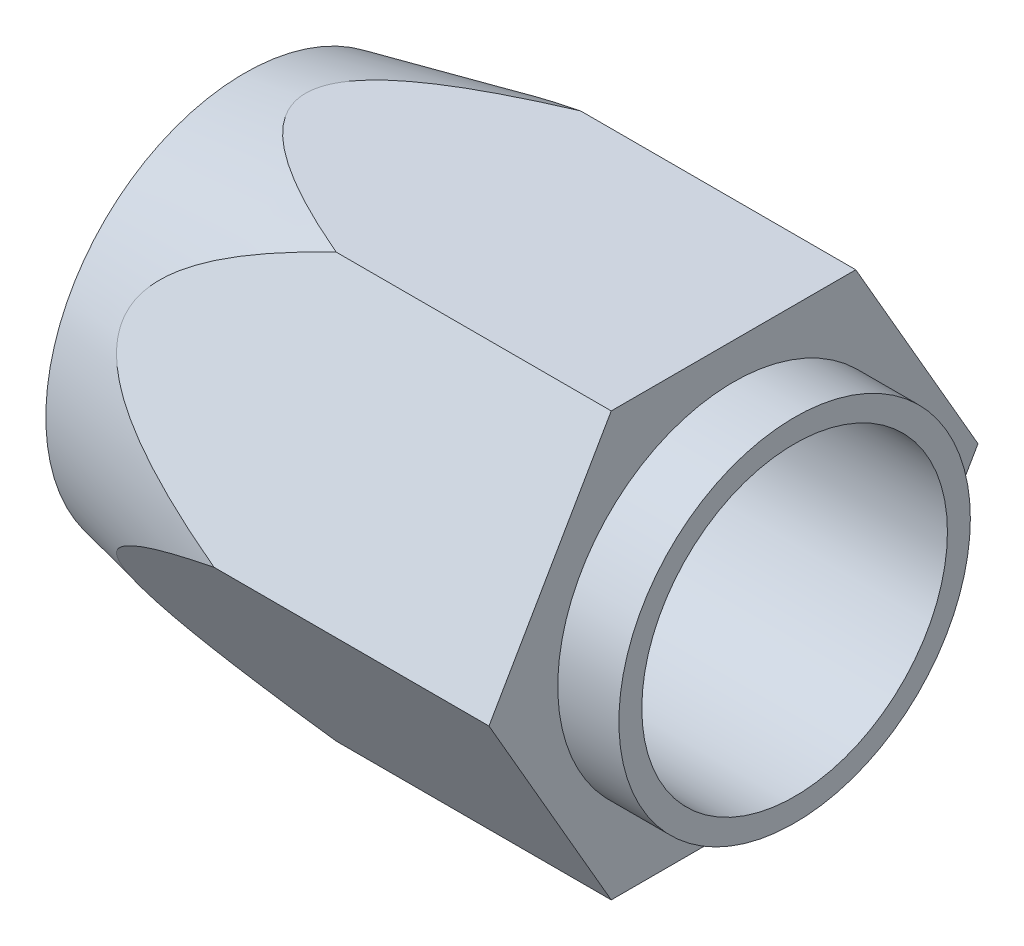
ISO-10303-21;
HEADER;
FILE_DESCRIPTION(('STEP AP214'),'2;1');
FILE_NAME('part.step','',(''),(''),'','','');
FILE_SCHEMA(('AUTOMOTIVE_DESIGN { 1 0 10303 214 1 1 1 1 }'));
ENDSEC;
DATA;
#1=APPLICATION_CONTEXT('core data for automotive mechanical design processes');
#2=APPLICATION_PROTOCOL_DEFINITION('international standard','automotive_design',2000,#1);
#3=PRODUCT_CONTEXT('',#1,'mechanical');
#4=PRODUCT('Part','Part','',(#3));
#5=PRODUCT_RELATED_PRODUCT_CATEGORY('part','',(#4));
#6=PRODUCT_DEFINITION_FORMATION('','',#4);
#7=PRODUCT_DEFINITION_CONTEXT('part definition',#1,'design');
#8=PRODUCT_DEFINITION('design','',#6,#7);
#9=PRODUCT_DEFINITION_SHAPE('','',#8);
#10=(LENGTH_UNIT() NAMED_UNIT(*) SI_UNIT(.MILLI.,.METRE.));
#11=(NAMED_UNIT(*) PLANE_ANGLE_UNIT() SI_UNIT($,.RADIAN.));
#12=(NAMED_UNIT(*) SI_UNIT($,.STERADIAN.) SOLID_ANGLE_UNIT());
#13=UNCERTAINTY_MEASURE_WITH_UNIT(LENGTH_MEASURE(1.E-05),#10,'distance_accuracy_value','');
#14=(GEOMETRIC_REPRESENTATION_CONTEXT(3) GLOBAL_UNCERTAINTY_ASSIGNED_CONTEXT((#13)) GLOBAL_UNIT_ASSIGNED_CONTEXT((#10,
#11,#12)) REPRESENTATION_CONTEXT('',''));
#15=CARTESIAN_POINT('',(0.,0.,0.));
#16=DIRECTION('',(0.,0.,1.));
#17=DIRECTION('',(1.,0.,0.));
#18=AXIS2_PLACEMENT_3D('',#15,#16,#17);
#19=CARTESIAN_POINT('',(16.,0.,0.));
#20=DIRECTION('',(1.,0.,0.));
#21=DIRECTION('',(0.,0.,-1.));
#22=AXIS2_PLACEMENT_3D('',#19,#20,#21);
#23=PLANE('',#22);
#24=CARTESIAN_POINT('',(16.,0.,0.));
#25=DIRECTION('',(1.,0.,0.));
#26=DIRECTION('',(0.,0.,-1.));
#27=AXIS2_PLACEMENT_3D('',#24,#25,#26);
#28=CIRCLE('',#27,5.75);
#29=CARTESIAN_POINT('',(16.,0.,-5.75));
#30=VERTEX_POINT('',#29);
#31=EDGE_CURVE('E19',#30,#30,#28,.T.);
#32=ORIENTED_EDGE('',*,*,#31,.F.);
#33=EDGE_LOOP('',(#32));
#34=FACE_BOUND('',#33,.T.);
#35=DIRECTION('',(0.,-0.866025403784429,0.500000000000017));
#36=VECTOR('',#35,1.);
#37=CARTESIAN_POINT('',(16.,6.928203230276,4.));
#38=LINE('',#37,#36);
#39=CARTESIAN_POINT('',(16.,1.32417225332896E-13,8.00000000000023));
#40=VERTEX_POINT('',#39);
#41=CARTESIAN_POINT('',(16.,6.928203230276,4.));
#42=VERTEX_POINT('',#41);
#43=EDGE_CURVE('E95',#40,#42,#38,.F.);
#44=ORIENTED_EDGE('',*,*,#43,.F.);
#45=DIRECTION('',(0.,-0.866025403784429,-0.500000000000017));
#46=VECTOR('',#45,1.);
#47=CARTESIAN_POINT('',(16.,0.,8.));
#48=LINE('',#47,#46);
#49=CARTESIAN_POINT('',(16.,-6.92820323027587,3.99999999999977));
#50=VERTEX_POINT('',#49);
#51=EDGE_CURVE('E100',#50,#40,#48,.F.);
#52=ORIENTED_EDGE('',*,*,#51,.F.);
#53=DIRECTION('',(0.,0.,-1.));
#54=VECTOR('',#53,1.);
#55=CARTESIAN_POINT('',(16.,-6.928203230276,4.));
#56=LINE('',#55,#54);
#57=CARTESIAN_POINT('',(16.,-6.928203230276,-4.));
#58=VERTEX_POINT('',#57);
#59=EDGE_CURVE('E105',#58,#50,#56,.F.);
#60=ORIENTED_EDGE('',*,*,#59,.F.);
#61=DIRECTION('',(0.,0.866025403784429,-0.500000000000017));
#62=VECTOR('',#61,1.);
#63=CARTESIAN_POINT('',(16.,-6.928203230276,-4.));
#64=LINE('',#63,#62);
#65=CARTESIAN_POINT('',(16.,0.,-8.00000000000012));
#66=VERTEX_POINT('',#65);
#67=EDGE_CURVE('E84',#66,#58,#64,.F.);
#68=ORIENTED_EDGE('',*,*,#67,.F.);
#69=DIRECTION('',(0.,0.866025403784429,0.500000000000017));
#70=VECTOR('',#69,1.);
#71=CARTESIAN_POINT('',(16.,0.,-8.));
#72=LINE('',#71,#70);
#73=CARTESIAN_POINT('',(16.,6.92820323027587,-3.99999999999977));
#74=VERTEX_POINT('',#73);
#75=EDGE_CURVE('E79',#74,#66,#72,.F.);
#76=ORIENTED_EDGE('',*,*,#75,.F.);
#77=DIRECTION('',(0.,0.,1.));
#78=VECTOR('',#77,1.);
#79=CARTESIAN_POINT('',(16.,6.928203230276,-4.));
#80=LINE('',#79,#78);
#81=EDGE_CURVE('E67',#42,#74,#80,.F.);
#82=ORIENTED_EDGE('',*,*,#81,.F.);
#83=EDGE_LOOP('',(#44,#52,#60,#68,#76,#82));
#84=FACE_BOUND('',#83,.T.);
#85=ADVANCED_FACE('F16',(#34,#84),#23,.T.);
#86=CARTESIAN_POINT('',(0.,-6.928203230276,-4.));
#87=DIRECTION('',(0.,-0.500000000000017,-0.866025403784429));
#88=DIRECTION('',(0.,0.866025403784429,-0.500000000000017));
#89=AXIS2_PLACEMENT_3D('',#86,#87,#88);
#90=PLANE('',#89);
#91=DIRECTION('',(1.,0.,0.));
#92=VECTOR('',#91,1.);
#93=CARTESIAN_POINT('',(0.,-6.928203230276,-4.));
#94=LINE('',#93,#92);
#95=CARTESIAN_POINT('',(6.99999996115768,-6.92820321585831,-4.00000000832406));
#96=VERTEX_POINT('',#95);
#97=EDGE_CURVE('E107',#96,#58,#94,.T.);
#98=ORIENTED_EDGE('',*,*,#97,.F.);
#99=CARTESIAN_POINT('',(7.00000000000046,-1.11640859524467E-12,-7.99999999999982));
#100=CARTESIAN_POINT('',(6.87265688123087,-0.0472672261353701,-7.97271025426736));
#101=CARTESIAN_POINT('',(6.74561469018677,-0.0951407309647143,-7.94507047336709));
#102=CARTESIAN_POINT('',(6.49221876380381,-0.192257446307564,-7.88900011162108));
#103=CARTESIAN_POINT('',(6.36586508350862,-0.241500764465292,-7.86056946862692));
#104=CARTESIAN_POINT('',(5.98753065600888,-0.391694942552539,-7.77385481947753));
#105=CARTESIAN_POINT('',(5.73674853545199,-0.494936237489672,-7.71424843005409));
#106=CARTESIAN_POINT('',(5.24148256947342,-0.708414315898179,-7.59099680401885));
#107=CARTESIAN_POINT('',(4.99696581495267,-0.818593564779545,-7.52738478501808));
#108=CARTESIAN_POINT('',(4.51446996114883,-1.04899700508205,-7.3943612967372));
#109=CARTESIAN_POINT('',(4.2764855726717,-1.16921273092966,-7.32495471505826));
#110=CARTESIAN_POINT('',(3.88880209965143,-1.38097779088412,-7.20269210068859));
#111=CARTESIAN_POINT('',(3.73626687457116,-1.46861610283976,-7.15209409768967));
#112=CARTESIAN_POINT('',(3.43662864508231,-1.65244292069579,-7.04596163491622));
#113=CARTESIAN_POINT('',(3.289566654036,-1.74868255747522,-6.9903976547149));
#114=CARTESIAN_POINT('',(3.05556825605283,-1.91587951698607,-6.89386644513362));
#115=CARTESIAN_POINT('',(2.96572772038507,-1.98377409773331,-6.85466749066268));
#116=CARTESIAN_POINT('',(2.79167839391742,-2.12497886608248,-6.77314287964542));
#117=CARTESIAN_POINT('',(2.70747484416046,-2.19829396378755,-6.73081438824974));
#118=CARTESIAN_POINT('',(2.54777816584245,-2.35071410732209,-6.64281457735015));
#119=CARTESIAN_POINT('',(2.47221921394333,-2.42976668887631,-6.59717354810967));
#120=CARTESIAN_POINT('',(2.33268075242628,-2.59509526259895,-6.50172105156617));
#121=CARTESIAN_POINT('',(2.26867217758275,-2.68135230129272,-6.45192052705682));
#122=CARTESIAN_POINT('',(2.1691285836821,-2.84247247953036,-6.35889774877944));
#123=CARTESIAN_POINT('',(2.13043256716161,-2.91584626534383,-6.31653537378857));
#124=CARTESIAN_POINT('',(2.06651997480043,-3.06690215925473,-6.22932321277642));
#125=CARTESIAN_POINT('',(2.04128764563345,-3.1445791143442,-6.18447640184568));
#126=CARTESIAN_POINT('',(2.00703851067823,-3.3033790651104,-6.09279320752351));
#127=CARTESIAN_POINT('',(1.99816763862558,-3.3845265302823,-6.04594269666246));
#128=CARTESIAN_POINT('',(1.99839807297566,-3.54682739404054,-5.95223824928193));
#129=CARTESIAN_POINT('',(2.00750391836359,-3.62798078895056,-5.90538431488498));
#130=CARTESIAN_POINT('',(2.04065302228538,-3.7797371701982,-5.8177677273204));
#131=CARTESIAN_POINT('',(2.063167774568,-3.85060185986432,-5.77685397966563));
#132=CARTESIAN_POINT('',(2.11954328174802,-3.98879057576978,-5.69707068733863));
#133=CARTESIAN_POINT('',(2.153406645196,-4.05611378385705,-5.65820161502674));
#134=CARTESIAN_POINT('',(2.25961579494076,-4.23713595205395,-5.55368841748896));
#135=CARTESIAN_POINT('',(2.34150712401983,-4.34659339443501,-5.49049313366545));
#136=CARTESIAN_POINT('',(2.52282053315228,-4.5541261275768,-5.37067405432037));
#137=CARTESIAN_POINT('',(2.62231633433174,-4.65215055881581,-5.31407962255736));
#138=CARTESIAN_POINT('',(2.80179381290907,-4.81159731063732,-5.2220229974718));
#139=CARTESIAN_POINT('',(2.87904171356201,-4.8753769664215,-5.18519979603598));
#140=CARTESIAN_POINT('',(3.03774498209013,-4.9989017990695,-5.11388270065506));
#141=CARTESIAN_POINT('',(3.11920169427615,-5.05864567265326,-5.07938955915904));
#142=CARTESIAN_POINT('',(3.36860734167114,-5.23297539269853,-4.97874024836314));
#143=CARTESIAN_POINT('',(3.54132243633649,-5.34243160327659,-4.91554567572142));
#144=CARTESIAN_POINT('',(3.89562308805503,-5.55194773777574,-4.79458147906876));
#145=CARTESIAN_POINT('',(4.0772582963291,-5.65194311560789,-4.73684912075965));
#146=CARTESIAN_POINT('',(4.44591881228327,-5.84424584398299,-4.62582308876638));
#147=CARTESIAN_POINT('',(4.63294579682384,-5.93655076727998,-4.57253081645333));
#148=CARTESIAN_POINT('',(5.00033307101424,-6.11017633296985,-4.47228804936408));
#149=CARTESIAN_POINT('',(5.18049033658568,-6.19182211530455,-4.42514983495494));
#150=CARTESIAN_POINT('',(5.54341642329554,-6.35075058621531,-4.33339243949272));
#151=CARTESIAN_POINT('',(5.72618606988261,-6.42803185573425,-4.28877407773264));
#152=CARTESIAN_POINT('',(6.09000990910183,-6.57744443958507,-4.20251068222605));
#153=CARTESIAN_POINT('',(6.27102470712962,-6.64964805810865,-4.16082390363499));
#154=CARTESIAN_POINT('',(6.63449583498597,-6.79104334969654,-4.07918929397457));
#155=CARTESIAN_POINT('',(6.81695129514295,-6.8602366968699,-4.0392404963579));
#156=CARTESIAN_POINT('',(6.99999992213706,-6.92820320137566,-4.00000001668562));
#157=B_SPLINE_CURVE_WITH_KNOTS('',3,(#99,#100,#101,#102,#103,#104,#105,#106,#107,#108,#109,#110,
#111,#112,#113,#114,#115,#116,#117,#118,#119,#120,#121,#122,#123,#124,#125,#126,#127,#128,#129,
#130,#131,#132,#133,#134,#135,#136,#137,#138,#139,#140,#141,#142,#143,#144,#145,#146,#147,#148,
#149,#150,#151,#152,#153,#154,#155,#156),.UNSPECIFIED.,.F.,.F.,(4,2,2,2,2,2,2,2,2,2,2,2,2,2,2,2,
2,2,2,2,2,2,2,2,2,2,2,2,4),(0.,0.415635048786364,0.831302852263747,1.6641767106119,
2.49087611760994,3.31688513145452,3.86581444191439,4.41825684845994,4.77575088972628,
5.13357282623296,5.48845770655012,5.84243671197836,6.12097828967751,6.39919323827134,
6.67987790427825,6.96063345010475,7.21425825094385,7.46794138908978,7.91711501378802,
8.36821616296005,8.68819996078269,9.00828660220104,9.64958384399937,10.2949810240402,
10.9405811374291,11.5504912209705,12.1605984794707,12.7584388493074,13.3559423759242),.UNSPECIFIED.);
#158=CARTESIAN_POINT('',(7.00000000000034,-3.57415779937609E-13,-7.99999999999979));
#159=VERTEX_POINT('',#158);
#160=EDGE_CURVE('E167',#159,#96,#157,.T.);
#161=ORIENTED_EDGE('',*,*,#160,.F.);
#162=DIRECTION('',(1.,0.,0.));
#163=VECTOR('',#162,1.);
#164=CARTESIAN_POINT('',(0.,0.,-8.));
#165=LINE('',#164,#163);
#166=EDGE_CURVE('E33',#66,#159,#165,.F.);
#167=ORIENTED_EDGE('',*,*,#166,.F.);
#168=ORIENTED_EDGE('',*,*,#67,.T.);
#169=EDGE_LOOP('',(#98,#161,#167,#168));
#170=FACE_BOUND('',#169,.T.);
#171=ADVANCED_FACE('F175',(#170),#90,.T.);
#172=CARTESIAN_POINT('',(0.,-6.928203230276,4.));
#173=DIRECTION('',(0.,-1.,0.));
#174=DIRECTION('',(0.,0.,-1.));
#175=AXIS2_PLACEMENT_3D('',#172,#173,#174);
#176=PLANE('',#175);
#177=DIRECTION('',(1.,0.,0.));
#178=VECTOR('',#177,1.);
#179=CARTESIAN_POINT('',(0.,-6.9282032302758,3.99999999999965));
#180=LINE('',#179,#178);
#181=CARTESIAN_POINT('',(6.99999996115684,-6.9282032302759,3.9999999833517));
#182=VERTEX_POINT('',#181);
#183=EDGE_CURVE('E102',#182,#50,#180,.T.);
#184=ORIENTED_EDGE('',*,*,#183,.F.);
#185=CARTESIAN_POINT('',(6.99999992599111,-6.928203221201,-3.99999996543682));
#186=CARTESIAN_POINT('',(6.87265680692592,-6.92820322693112,-3.94542047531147));
#187=CARTESIAN_POINT('',(6.74561461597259,-6.9282032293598,-3.89014091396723));
#188=CARTESIAN_POINT('',(6.49221869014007,-6.92820323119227,-3.77800019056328));
#189=CARTESIAN_POINT('',(6.36586501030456,-6.92820323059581,-3.7211389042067));
#190=CARTESIAN_POINT('',(5.98753058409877,-6.92820322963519,-3.54770960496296));
#191=CARTESIAN_POINT('',(5.73674846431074,-6.92820323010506,-3.42849682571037));
#192=CARTESIAN_POINT('',(5.24148250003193,-6.92820323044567,-3.18199357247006));
#193=CARTESIAN_POINT('',(4.99696574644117,-6.92820323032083,-3.0547695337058));
#194=CARTESIAN_POINT('',(4.51446989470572,-6.9282032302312,-2.78872255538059));
#195=CARTESIAN_POINT('',(4.27648550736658,-6.92820323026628,-2.64990939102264));
#196=CARTESIAN_POINT('',(3.88880204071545,-6.92820323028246,-2.40538416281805));
#197=CARTESIAN_POINT('',(3.73626682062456,-6.92820323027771,-2.30418815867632));
#198=CARTESIAN_POINT('',(3.43662860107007,-6.92820323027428,-2.09192323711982));
#199=CARTESIAN_POINT('',(3.28956661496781,-6.92820323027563,-1.98079527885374));
#200=CARTESIAN_POINT('',(3.0555682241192,-6.92820323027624,-1.78773286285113));
#201=CARTESIAN_POINT('',(2.96572769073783,-6.92820323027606,-1.70933495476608));
#202=CARTESIAN_POINT('',(2.79167836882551,-6.92820323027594,-1.54628573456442));
#203=CARTESIAN_POINT('',(2.70747482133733,-6.92820323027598,-1.46162875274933));
#204=CARTESIAN_POINT('',(2.54777814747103,-6.92820323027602,-1.28562913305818));
#205=CARTESIAN_POINT('',(2.47221919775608,-6.928203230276,-1.19434707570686));
#206=CARTESIAN_POINT('',(2.33268074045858,-6.928203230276,-1.00344208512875));
#207=CARTESIAN_POINT('',(2.26867216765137,-6.928203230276,-0.90384103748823));
#208=CARTESIAN_POINT('',(2.16912857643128,-6.928203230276,-0.717795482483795));
#209=CARTESIAN_POINT('',(2.13043256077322,-6.928203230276,-0.633070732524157));
#210=CARTESIAN_POINT('',(2.06651997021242,-6.928203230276,-0.458646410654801));
#211=CARTESIAN_POINT('',(2.04128764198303,-6.928203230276,-0.368952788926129));
#212=CARTESIAN_POINT('',(2.00703850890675,-6.928203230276,-0.185586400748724));
#213=CARTESIAN_POINT('',(1.99816763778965,-6.928203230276,-0.091885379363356));
#214=CARTESIAN_POINT('',(1.99839807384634,-6.928203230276,0.0955235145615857));
#215=CARTESIAN_POINT('',(2.00750392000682,-6.928203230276,0.189231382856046));
#216=CARTESIAN_POINT('',(2.04065302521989,-6.928203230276,0.364464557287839));
#217=CARTESIAN_POINT('',(2.06316777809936,-6.928203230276,0.446292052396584));
#218=CARTESIAN_POINT('',(2.11954328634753,-6.928203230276,0.605858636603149));
#219=CARTESIAN_POINT('',(2.15340665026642,-6.928203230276,0.683596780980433));
#220=CARTESIAN_POINT('',(2.25961580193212,-6.928203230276,0.892623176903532));
#221=CARTESIAN_POINT('',(2.34150713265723,-6.928203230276,1.01901374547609));
#222=CARTESIAN_POINT('',(2.52282054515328,-6.928203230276,1.25865190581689));
#223=CARTESIAN_POINT('',(2.62231634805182,-6.928203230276,1.37184077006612));
#224=CARTESIAN_POINT('',(2.80179383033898,-6.928203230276,1.55595402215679));
#225=CARTESIAN_POINT('',(2.87904173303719,-6.928203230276,1.62960042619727));
#226=CARTESIAN_POINT('',(3.03774500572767,-6.928203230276,1.77223461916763));
#227=CARTESIAN_POINT('',(3.11920172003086,-6.928203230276,1.84122090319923));
#228=CARTESIAN_POINT('',(3.36860737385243,-6.928203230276,2.0425195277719));
#229=CARTESIAN_POINT('',(3.5413224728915,-6.928203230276,2.16890867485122));
#230=CARTESIAN_POINT('',(3.89562313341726,-6.928203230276,2.41083707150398));
#231=CARTESIAN_POINT('',(4.07725834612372,-6.928203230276,2.5263017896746));
#232=CARTESIAN_POINT('',(4.44591887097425,-6.928203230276,2.7483538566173));
#233=CARTESIAN_POINT('',(4.63294585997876,-6.928203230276,2.8549384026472));
#234=CARTESIAN_POINT('',(5.00033313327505,-6.928203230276,3.05542393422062));
#235=CARTESIAN_POINT('',(5.18049039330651,-6.928203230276,3.14970035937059));
#236=CARTESIAN_POINT('',(5.54341646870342,-6.928203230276,3.33321514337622));
#237=CARTESIAN_POINT('',(5.72618610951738,-6.928203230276,3.42245186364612));
#238=CARTESIAN_POINT('',(6.09000993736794,-6.928203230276,3.59497864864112));
#239=CARTESIAN_POINT('',(6.27102472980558,-6.928203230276,3.67835220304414));
#240=CARTESIAN_POINT('',(6.63449584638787,-6.928203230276,3.84162141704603));
#241=CARTESIAN_POINT('',(6.81695130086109,-6.928203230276,3.92151900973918));
#242=CARTESIAN_POINT('',(6.999999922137,-6.928203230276,3.99999996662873));
#243=B_SPLINE_CURVE_WITH_KNOTS('',3,(#185,#186,#187,#188,#189,#190,#191,#192,#193,#194,#195,
#196,#197,#198,#199,#200,#201,#202,#203,#204,#205,#206,#207,#208,#209,#210,#211,#212,#213,#214,
#215,#216,#217,#218,#219,#220,#221,#222,#223,#224,#225,#226,#227,#228,#229,#230,#231,#232,#233,
#234,#235,#236,#237,#238,#239,#240,#241,#242),.UNSPECIFIED.,.F.,.F.,(4,2,2,2,2,2,2,2,2,2,2,2,2,
2,2,2,2,2,2,2,2,2,2,2,2,2,2,2,4),(0.,0.415635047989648,0.831302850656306,1.66417670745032,
2.49087611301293,3.31688512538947,3.8658144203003,4.41825681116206,4.77575084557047,
5.1335727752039,5.48845764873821,5.84243664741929,6.12097822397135,6.39919317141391,
6.67987783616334,6.96063338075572,7.21425818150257,7.46794131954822,7.91711494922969,
8.3682161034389,8.68819990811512,9.008286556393,9.64958381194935,10.294981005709,
10.9405811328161,11.5504911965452,12.1605984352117,12.7584387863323,13.3559422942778),.UNSPECIFIED.);
#244=EDGE_CURVE('E162',#96,#182,#243,.T.);
#245=ORIENTED_EDGE('',*,*,#244,.F.);
#246=ORIENTED_EDGE('',*,*,#97,.T.);
#247=ORIENTED_EDGE('',*,*,#59,.T.);
#248=EDGE_LOOP('',(#184,#245,#246,#247));
#249=FACE_BOUND('',#248,.T.);
#250=ADVANCED_FACE('F172',(#249),#176,.T.);
#251=CARTESIAN_POINT('',(0.,0.,8.));
#252=DIRECTION('',(0.,-0.500000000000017,0.866025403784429));
#253=DIRECTION('',(0.,-0.866025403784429,-0.500000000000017));
#254=AXIS2_PLACEMENT_3D('',#251,#252,#253);
#255=PLANE('',#254);
#256=DIRECTION('',(1.,0.,0.));
#257=VECTOR('',#256,1.);
#258=CARTESIAN_POINT('',(0.,1.98625837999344E-13,8.00000000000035));
#259=LINE('',#258,#257);
#260=CARTESIAN_POINT('',(7.00000000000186,-1.96959231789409E-13,8.00000000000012));
#261=VERTEX_POINT('',#260);
#262=EDGE_CURVE('E97',#261,#40,#259,.T.);
#263=ORIENTED_EDGE('',*,*,#262,.F.);
#264=CARTESIAN_POINT('',(6.99999992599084,-6.92820319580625,4.00000000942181));
#265=CARTESIAN_POINT('',(6.87265680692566,-6.88093597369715,4.02728975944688));
#266=CARTESIAN_POINT('',(6.74561461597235,-6.83306247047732,4.05492954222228));
#267=CARTESIAN_POINT('',(6.49221869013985,-6.73594575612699,4.1109999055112));
#268=CARTESIAN_POINT('',(6.36586501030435,-6.68670243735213,4.13943054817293));
#269=CARTESIAN_POINT('',(5.9875305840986,-6.53650825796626,4.22614519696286));
#270=CARTESIAN_POINT('',(5.73674846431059,-6.43326696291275,4.28575158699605));
#271=CARTESIAN_POINT('',(5.24148250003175,-6.2197888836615,4.40900321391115));
#272=CARTESIAN_POINT('',(4.99696574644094,-6.1096096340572,4.47261523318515));
#273=CARTESIAN_POINT('',(4.5144698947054,-5.87920619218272,4.60563872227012));
#274=CARTESIAN_POINT('',(4.2764855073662,-5.7589904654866,4.67504530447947));
#275=CARTESIAN_POINT('',(3.88880204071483,-5.5472254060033,4.79730791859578));
#276=CARTESIAN_POINT('',(3.73626682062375,-5.45958709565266,4.84790592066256));
#277=CARTESIAN_POINT('',(3.43662860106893,-5.27576028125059,4.95403838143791));
#278=CARTESIAN_POINT('',(3.2895666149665,-5.17952064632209,5.00960236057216));
#279=CARTESIAN_POINT('',(3.05556822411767,-5.01232368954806,5.10613356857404));
#280=CARTESIAN_POINT('',(2.96572769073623,-4.94442910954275,5.14533252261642));
#281=CARTESIAN_POINT('',(2.79167836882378,-4.80322434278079,5.22685713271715));
#282=CARTESIAN_POINT('',(2.70747482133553,-4.72990924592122,5.26918562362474));
#283=CARTESIAN_POINT('',(2.54777814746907,-4.57748910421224,5.35718543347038));
#284=CARTESIAN_POINT('',(2.47221919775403,-4.49843652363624,5.40282646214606));
#285=CARTESIAN_POINT('',(2.33268074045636,-4.33310795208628,5.49827895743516));
#286=CARTESIAN_POINT('',(2.26867216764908,-4.246850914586,5.54807948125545));
#287=CARTESIAN_POINT('',(2.16912857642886,-4.08573073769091,5.64110225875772));
#288=CARTESIAN_POINT('',(2.13043256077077,-4.01235695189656,5.68346463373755));
#289=CARTESIAN_POINT('',(2.06651997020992,-3.86130105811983,5.77067679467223));
#290=CARTESIAN_POINT('',(2.04128764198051,-3.7836241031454,5.81552360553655));
#291=CARTESIAN_POINT('',(2.00703850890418,-3.62482415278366,5.9072067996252));
#292=CARTESIAN_POINT('',(1.99816763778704,-3.54367668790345,5.95405731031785));
#293=CARTESIAN_POINT('',(1.99839807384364,-3.3813758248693,6.04776175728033));
#294=CARTESIAN_POINT('',(2.00750392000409,-3.30022243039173,6.09461569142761));
#295=CARTESIAN_POINT('',(2.04065302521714,-3.14846604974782,6.18223227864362));
#296=CARTESIAN_POINT('',(2.06316777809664,-3.07760136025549,6.22314602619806));
#297=CARTESIAN_POINT('',(2.1195432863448,-2.9394126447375,6.30292931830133));
#298=CARTESIAN_POINT('',(2.15340665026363,-2.87208943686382,6.34179839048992));
#299=CARTESIAN_POINT('',(2.25961580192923,-2.691067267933,6.44631158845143));
#300=CARTESIAN_POINT('',(2.34150713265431,-2.5816098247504,6.50950687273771));
#301=CARTESIAN_POINT('',(2.52282054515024,-2.37407709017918,6.62932595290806));
#302=CARTESIAN_POINT('',(2.62231634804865,-2.27605265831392,6.68592038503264));
#303=CARTESIAN_POINT('',(2.80179383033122,-2.11660590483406,6.77797701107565));
#304=CARTESIAN_POINT('',(2.87904173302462,-2.0528262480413,6.81480021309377));
#305=CARTESIAN_POINT('',(3.03774500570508,-1.92930141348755,6.88611730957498));
#306=CARTESIAN_POINT('',(3.11920172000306,-1.86955753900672,6.92061045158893));
#307=CARTESIAN_POINT('',(3.36860737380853,-1.69522781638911,7.02125976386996));
#308=CARTESIAN_POINT('',(3.5413224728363,-1.58577160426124,7.08445433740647));
#309=CARTESIAN_POINT('',(3.89562313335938,-1.37625546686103,7.20541853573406));
#310=CARTESIAN_POINT('',(4.07725834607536,-1.27626008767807,7.26315089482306));
#311=CARTESIAN_POINT('',(4.44591887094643,-1.08395735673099,7.37417692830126));
#312=CARTESIAN_POINT('',(4.63294585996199,-0.991652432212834,7.42746920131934));
#313=CARTESIAN_POINT('',(5.00033313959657,-0.81802686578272,7.52771196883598));
#314=CARTESIAN_POINT('',(5.18049040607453,-0.736381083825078,7.57485018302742));
#315=CARTESIAN_POINT('',(5.54341649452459,-0.577452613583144,7.6666075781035));
#316=CARTESIAN_POINT('',(5.72618614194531,-0.500171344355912,7.71122593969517));
#317=CARTESIAN_POINT('',(6.09000998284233,-0.35075876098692,7.79748933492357));
#318=CARTESIAN_POINT('',(6.2710247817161,-0.278555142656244,7.83917611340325));
#319=CARTESIAN_POINT('',(6.63449591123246,-0.137159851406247,7.92081072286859));
#320=CARTESIAN_POINT('',(6.81695137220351,-0.0679665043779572,7.9607595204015));
#321=CARTESIAN_POINT('',(7.00000000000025,-3.93285059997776E-13,7.99999999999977));
#322=B_SPLINE_CURVE_WITH_KNOTS('',3,(#264,#265,#266,#267,#268,#269,#270,#271,#272,#273,#274,
#275,#276,#277,#278,#279,#280,#281,#282,#283,#284,#285,#286,#287,#288,#289,#290,#291,#292,#293,
#294,#295,#296,#297,#298,#299,#300,#301,#302,#303,#304,#305,#306,#307,#308,#309,#310,#311,#312,
#313,#314,#315,#316,#317,#318,#319,#320,#321),.UNSPECIFIED.,.F.,.F.,(4,2,2,2,2,2,2,2,2,2,2,2,2,
2,2,2,2,2,2,2,2,2,2,2,2,2,2,2,4),(0.,0.415635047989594,0.831302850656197,1.66417670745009,
2.49087611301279,3.31688512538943,3.86581442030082,4.41825681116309,4.77575084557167,
5.13357277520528,5.48845764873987,5.84243664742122,6.12097822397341,6.39919317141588,
6.67987783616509,6.96063338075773,7.21425818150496,7.46794131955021,7.91711494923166,
8.36821610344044,8.68819990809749,9.00828655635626,9.64958381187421,10.2949810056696,
10.9405811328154,11.550491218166,12.1605984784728,12.7584388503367,13.3559423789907),.UNSPECIFIED.);
#323=EDGE_CURVE('E156',#182,#261,#322,.T.);
#324=ORIENTED_EDGE('',*,*,#323,.F.);
#325=ORIENTED_EDGE('',*,*,#183,.T.);
#326=ORIENTED_EDGE('',*,*,#51,.T.);
#327=EDGE_LOOP('',(#263,#324,#325,#326));
#328=FACE_BOUND('',#327,.T.);
#329=ADVANCED_FACE('F146',(#328),#255,.T.);
#330=CARTESIAN_POINT('',(0.,6.928203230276,4.));
#331=DIRECTION('',(0.,0.500000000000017,0.866025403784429));
#332=DIRECTION('',(0.,-0.866025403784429,0.500000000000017));
#333=AXIS2_PLACEMENT_3D('',#330,#331,#332);
#334=PLANE('',#333);
#335=DIRECTION('',(1.,0.,0.));
#336=VECTOR('',#335,1.);
#337=CARTESIAN_POINT('',(0.,6.928203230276,4.));
#338=LINE('',#337,#336);
#339=CARTESIAN_POINT('',(6.99999996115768,6.92820321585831,4.00000000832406));
#340=VERTEX_POINT('',#339);
#341=EDGE_CURVE('E73',#340,#42,#338,.T.);
#342=ORIENTED_EDGE('',*,*,#341,.F.);
#343=CARTESIAN_POINT('',(7.00000000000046,1.11609577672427E-12,7.99999999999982));
#344=CARTESIAN_POINT('',(6.87265688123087,0.0472672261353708,7.97271025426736));
#345=CARTESIAN_POINT('',(6.74561469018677,0.095140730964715,7.94507047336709));
#346=CARTESIAN_POINT('',(6.49221876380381,0.192257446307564,7.88900011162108));
#347=CARTESIAN_POINT('',(6.36586508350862,0.241500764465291,7.86056946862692));
#348=CARTESIAN_POINT('',(5.98753065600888,0.391694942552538,7.77385481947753));
#349=CARTESIAN_POINT('',(5.736748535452,0.494936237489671,7.71424843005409));
#350=CARTESIAN_POINT('',(5.24148256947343,0.708414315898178,7.59099680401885));
#351=CARTESIAN_POINT('',(4.99696581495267,0.818593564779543,7.52738478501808));
#352=CARTESIAN_POINT('',(4.51446996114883,1.04899700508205,7.3943612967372));
#353=CARTESIAN_POINT('',(4.2764855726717,1.16921273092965,7.32495471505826));
#354=CARTESIAN_POINT('',(3.88880209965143,1.38097779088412,7.20269210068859));
#355=CARTESIAN_POINT('',(3.73626687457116,1.46861610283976,7.15209409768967));
#356=CARTESIAN_POINT('',(3.43662864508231,1.65244292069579,7.04596163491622));
#357=CARTESIAN_POINT('',(3.289566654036,1.74868255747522,6.9903976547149));
#358=CARTESIAN_POINT('',(3.05556825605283,1.91587951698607,6.89386644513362));
#359=CARTESIAN_POINT('',(2.96572772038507,1.98377409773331,6.85466749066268));
#360=CARTESIAN_POINT('',(2.79167839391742,2.12497886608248,6.77314287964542));
#361=CARTESIAN_POINT('',(2.70747484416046,2.19829396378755,6.73081438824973));
#362=CARTESIAN_POINT('',(2.54777816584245,2.35071410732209,6.64281457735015));
#363=CARTESIAN_POINT('',(2.47221921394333,2.42976668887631,6.59717354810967));
#364=CARTESIAN_POINT('',(2.33268075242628,2.59509526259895,6.50172105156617));
#365=CARTESIAN_POINT('',(2.26867217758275,2.68135230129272,6.45192052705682));
#366=CARTESIAN_POINT('',(2.1691285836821,2.84247247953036,6.35889774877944));
#367=CARTESIAN_POINT('',(2.13043256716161,2.91584626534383,6.31653537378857));
#368=CARTESIAN_POINT('',(2.06651997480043,3.06690215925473,6.22932321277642));
#369=CARTESIAN_POINT('',(2.04128764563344,3.14457911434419,6.18447640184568));
#370=CARTESIAN_POINT('',(2.00703851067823,3.3033790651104,6.09279320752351));
#371=CARTESIAN_POINT('',(1.99816763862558,3.38452653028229,6.04594269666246));
#372=CARTESIAN_POINT('',(1.99839807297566,3.54682739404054,5.95223824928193));
#373=CARTESIAN_POINT('',(2.00750391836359,3.62798078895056,5.90538431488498));
#374=CARTESIAN_POINT('',(2.04065302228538,3.7797371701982,5.8177677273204));
#375=CARTESIAN_POINT('',(2.063167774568,3.85060185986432,5.77685397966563));
#376=CARTESIAN_POINT('',(2.11954328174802,3.98879057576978,5.69707068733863));
#377=CARTESIAN_POINT('',(2.153406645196,4.05611378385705,5.65820161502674));
#378=CARTESIAN_POINT('',(2.25961579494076,4.23713595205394,5.55368841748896));
#379=CARTESIAN_POINT('',(2.34150712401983,4.34659339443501,5.49049313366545));
#380=CARTESIAN_POINT('',(2.52282053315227,4.5541261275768,5.37067405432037));
#381=CARTESIAN_POINT('',(2.62231633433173,4.65215055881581,5.31407962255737));
#382=CARTESIAN_POINT('',(2.80179381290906,4.81159731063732,5.2220229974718));
#383=CARTESIAN_POINT('',(2.87904171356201,4.87537696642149,5.18519979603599));
#384=CARTESIAN_POINT('',(3.03774498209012,4.99890179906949,5.11388270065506));
#385=CARTESIAN_POINT('',(3.11920169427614,5.05864567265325,5.07938955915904));
#386=CARTESIAN_POINT('',(3.36860734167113,5.23297539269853,4.97874024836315));
#387=CARTESIAN_POINT('',(3.54132243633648,5.34243160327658,4.91554567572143));
#388=CARTESIAN_POINT('',(3.89562308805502,5.55194773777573,4.79458147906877));
#389=CARTESIAN_POINT('',(4.07725829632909,5.65194311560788,4.73684912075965));
#390=CARTESIAN_POINT('',(4.44591881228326,5.84424584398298,4.62582308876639));
#391=CARTESIAN_POINT('',(4.63294579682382,5.93655076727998,4.57253081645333));
#392=CARTESIAN_POINT('',(5.00033307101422,6.11017633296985,4.47228804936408));
#393=CARTESIAN_POINT('',(5.18049033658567,6.19182211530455,4.42514983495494));
#394=CARTESIAN_POINT('',(5.54341642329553,6.3507505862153,4.33339243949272));
#395=CARTESIAN_POINT('',(5.7261860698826,6.42803185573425,4.28877407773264));
#396=CARTESIAN_POINT('',(6.09000990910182,6.57744443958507,4.20251068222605));
#397=CARTESIAN_POINT('',(6.27102470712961,6.64964805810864,4.16082390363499));
#398=CARTESIAN_POINT('',(6.63449583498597,6.79104334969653,4.07918929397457));
#399=CARTESIAN_POINT('',(6.81695129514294,6.8602366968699,4.0392404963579));
#400=CARTESIAN_POINT('',(6.99999992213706,6.92820320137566,4.00000001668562));
#401=B_SPLINE_CURVE_WITH_KNOTS('',3,(#343,#344,#345,#346,#347,#348,#349,#350,#351,#352,#353,
#354,#355,#356,#357,#358,#359,#360,#361,#362,#363,#364,#365,#366,#367,#368,#369,#370,#371,#372,
#373,#374,#375,#376,#377,#378,#379,#380,#381,#382,#383,#384,#385,#386,#387,#388,#389,#390,#391,
#392,#393,#394,#395,#396,#397,#398,#399,#400),.UNSPECIFIED.,.F.,.F.,(4,2,2,2,2,2,2,2,2,2,2,2,2,
2,2,2,2,2,2,2,2,2,2,2,2,2,2,2,4),(0.,0.415635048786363,0.831302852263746,1.66417671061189,
2.49087611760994,3.31688513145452,3.86581444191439,4.41825684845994,4.77575088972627,
5.13357282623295,5.48845770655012,5.84243671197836,6.1209782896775,6.39919323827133,
6.67987790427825,6.96063345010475,7.21425825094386,7.46794138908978,7.91711501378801,
8.36821616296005,8.68819996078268,9.00828660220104,9.64958384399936,10.2949810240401,
10.9405811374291,11.5504912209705,12.1605984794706,12.7584388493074,13.3559423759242),.UNSPECIFIED.);
#402=EDGE_CURVE('E150',#261,#340,#401,.T.);
#403=ORIENTED_EDGE('',*,*,#402,.F.);
#404=ORIENTED_EDGE('',*,*,#262,.T.);
#405=ORIENTED_EDGE('',*,*,#43,.T.);
#406=EDGE_LOOP('',(#342,#403,#404,#405));
#407=FACE_BOUND('',#406,.T.);
#408=ADVANCED_FACE('F142',(#407),#334,.T.);
#409=CARTESIAN_POINT('',(0.,6.928203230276,-4.));
#410=DIRECTION('',(0.,1.,0.));
#411=DIRECTION('',(0.,0.,1.));
#412=AXIS2_PLACEMENT_3D('',#409,#410,#411);
#413=PLANE('',#412);
#414=DIRECTION('',(1.,0.,0.));
#415=VECTOR('',#414,1.);
#416=CARTESIAN_POINT('',(0.,6.9282032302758,-3.99999999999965));
#417=LINE('',#416,#415);
#418=CARTESIAN_POINT('',(6.99999996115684,6.9282032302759,-3.9999999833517));
#419=VERTEX_POINT('',#418);
#420=EDGE_CURVE('E71',#419,#74,#417,.T.);
#421=ORIENTED_EDGE('',*,*,#420,.F.);
#422=CARTESIAN_POINT('',(6.9999999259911,6.928203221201,3.99999996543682));
#423=CARTESIAN_POINT('',(6.87265680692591,6.92820322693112,3.94542047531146));
#424=CARTESIAN_POINT('',(6.74561461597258,6.9282032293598,3.89014091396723));
#425=CARTESIAN_POINT('',(6.49221869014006,6.92820323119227,3.77800019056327));
#426=CARTESIAN_POINT('',(6.36586501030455,6.92820323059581,3.7211389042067));
#427=CARTESIAN_POINT('',(5.98753058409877,6.92820322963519,3.54770960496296));
#428=CARTESIAN_POINT('',(5.73674846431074,6.92820323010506,3.42849682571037));
#429=CARTESIAN_POINT('',(5.24148250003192,6.92820323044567,3.18199357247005));
#430=CARTESIAN_POINT('',(4.99696574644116,6.92820323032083,3.0547695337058));
#431=CARTESIAN_POINT('',(4.51446989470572,6.9282032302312,2.78872255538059));
#432=CARTESIAN_POINT('',(4.27648550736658,6.92820323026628,2.64990939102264));
#433=CARTESIAN_POINT('',(3.88880204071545,6.92820323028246,2.40538416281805));
#434=CARTESIAN_POINT('',(3.73626682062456,6.92820323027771,2.30418815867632));
#435=CARTESIAN_POINT('',(3.43662860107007,6.92820323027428,2.09192323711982));
#436=CARTESIAN_POINT('',(3.28956661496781,6.92820323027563,1.98079527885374));
#437=CARTESIAN_POINT('',(3.0555682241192,6.92820323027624,1.78773286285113));
#438=CARTESIAN_POINT('',(2.96572769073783,6.92820323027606,1.70933495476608));
#439=CARTESIAN_POINT('',(2.79167836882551,6.92820323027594,1.54628573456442));
#440=CARTESIAN_POINT('',(2.70747482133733,6.92820323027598,1.46162875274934));
#441=CARTESIAN_POINT('',(2.54777814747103,6.92820323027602,1.28562913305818));
#442=CARTESIAN_POINT('',(2.47221919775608,6.928203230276,1.19434707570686));
#443=CARTESIAN_POINT('',(2.33268074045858,6.928203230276,1.00344208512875));
#444=CARTESIAN_POINT('',(2.26867216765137,6.928203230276,0.903841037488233));
#445=CARTESIAN_POINT('',(2.16912857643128,6.928203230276,0.717795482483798));
#446=CARTESIAN_POINT('',(2.13043256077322,6.928203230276,0.633070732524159));
#447=CARTESIAN_POINT('',(2.06651997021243,6.928203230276,0.458646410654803));
#448=CARTESIAN_POINT('',(2.04128764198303,6.928203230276,0.368952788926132));
#449=CARTESIAN_POINT('',(2.00703850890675,6.928203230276,0.185586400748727));
#450=CARTESIAN_POINT('',(1.99816763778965,6.928203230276,0.091885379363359));
#451=CARTESIAN_POINT('',(1.99839807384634,6.928203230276,-0.0955235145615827));
#452=CARTESIAN_POINT('',(2.00750392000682,6.928203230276,-0.189231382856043));
#453=CARTESIAN_POINT('',(2.04065302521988,6.928203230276,-0.364464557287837));
#454=CARTESIAN_POINT('',(2.06316777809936,6.928203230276,-0.446292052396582));
#455=CARTESIAN_POINT('',(2.11954328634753,6.928203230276,-0.605858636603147));
#456=CARTESIAN_POINT('',(2.15340665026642,6.928203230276,-0.683596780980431));
#457=CARTESIAN_POINT('',(2.25961580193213,6.928203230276,-0.892623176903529));
#458=CARTESIAN_POINT('',(2.34150713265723,6.928203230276,-1.01901374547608));
#459=CARTESIAN_POINT('',(2.52282054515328,6.928203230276,-1.25865190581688));
#460=CARTESIAN_POINT('',(2.62231634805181,6.928203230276,-1.37184077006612));
#461=CARTESIAN_POINT('',(2.80179383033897,6.928203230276,-1.55595402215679));
#462=CARTESIAN_POINT('',(2.87904173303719,6.928203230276,-1.62960042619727));
#463=CARTESIAN_POINT('',(3.03774500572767,6.928203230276,-1.77223461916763));
#464=CARTESIAN_POINT('',(3.11920172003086,6.928203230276,-1.84122090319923));
#465=CARTESIAN_POINT('',(3.36860737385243,6.928203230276,-2.04251952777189));
#466=CARTESIAN_POINT('',(3.54132247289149,6.928203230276,-2.16890867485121));
#467=CARTESIAN_POINT('',(3.89562313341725,6.928203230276,-2.41083707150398));
#468=CARTESIAN_POINT('',(4.07725834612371,6.928203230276,-2.52630178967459));
#469=CARTESIAN_POINT('',(4.44591887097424,6.928203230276,-2.74835385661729));
#470=CARTESIAN_POINT('',(4.63294585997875,6.928203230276,-2.85493840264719));
#471=CARTESIAN_POINT('',(5.00033313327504,6.928203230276,-3.05542393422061));
#472=CARTESIAN_POINT('',(5.18049039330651,6.928203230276,-3.14970035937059));
#473=CARTESIAN_POINT('',(5.54341646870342,6.928203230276,-3.33321514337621));
#474=CARTESIAN_POINT('',(5.72618610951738,6.928203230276,-3.42245186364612));
#475=CARTESIAN_POINT('',(6.09000993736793,6.928203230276,-3.59497864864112));
#476=CARTESIAN_POINT('',(6.27102472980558,6.928203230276,-3.67835220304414));
#477=CARTESIAN_POINT('',(6.63449584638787,6.928203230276,-3.84162141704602));
#478=CARTESIAN_POINT('',(6.81695130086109,6.928203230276,-3.92151900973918));
#479=CARTESIAN_POINT('',(6.999999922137,6.928203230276,-3.99999996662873));
#480=B_SPLINE_CURVE_WITH_KNOTS('',3,(#422,#423,#424,#425,#426,#427,#428,#429,#430,#431,#432,
#433,#434,#435,#436,#437,#438,#439,#440,#441,#442,#443,#444,#445,#446,#447,#448,#449,#450,#451,
#452,#453,#454,#455,#456,#457,#458,#459,#460,#461,#462,#463,#464,#465,#466,#467,#468,#469,#470,
#471,#472,#473,#474,#475,#476,#477,#478,#479),.UNSPECIFIED.,.F.,.F.,(4,2,2,2,2,2,2,2,2,2,2,2,2,
2,2,2,2,2,2,2,2,2,2,2,2,2,2,2,4),(0.,0.415635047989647,0.831302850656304,1.66417670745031,
2.49087611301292,3.31688512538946,3.86581442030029,4.41825681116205,4.77575084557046,
5.13357277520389,5.4884576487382,5.84243664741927,6.12097822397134,6.3991931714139,
6.67987783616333,6.9606333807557,7.21425818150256,7.46794131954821,7.91711494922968,
8.36821610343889,8.6881999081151,9.00828655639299,9.64958381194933,10.294981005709,
10.9405811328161,11.5504911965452,12.1605984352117,12.7584387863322,13.3559422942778),.UNSPECIFIED.);
#481=EDGE_CURVE('E125',#340,#419,#480,.T.);
#482=ORIENTED_EDGE('',*,*,#481,.F.);
#483=ORIENTED_EDGE('',*,*,#341,.T.);
#484=ORIENTED_EDGE('',*,*,#81,.T.);
#485=EDGE_LOOP('',(#421,#482,#483,#484));
#486=FACE_BOUND('',#485,.T.);
#487=ADVANCED_FACE('F69',(#486),#413,.T.);
#488=CARTESIAN_POINT('',(0.,0.,-8.));
#489=DIRECTION('',(0.,0.500000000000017,-0.866025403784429));
#490=DIRECTION('',(0.,0.866025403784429,0.500000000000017));
#491=AXIS2_PLACEMENT_3D('',#488,#489,#490);
#492=PLANE('',#491);
#493=ORIENTED_EDGE('',*,*,#166,.T.);
#494=CARTESIAN_POINT('',(6.99999992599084,6.92820319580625,-4.00000000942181));
#495=CARTESIAN_POINT('',(6.87265680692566,6.88093597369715,-4.02728975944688));
#496=CARTESIAN_POINT('',(6.74561461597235,6.83306247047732,-4.05492954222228));
#497=CARTESIAN_POINT('',(6.49221869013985,6.73594575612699,-4.1109999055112));
#498=CARTESIAN_POINT('',(6.36586501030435,6.68670243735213,-4.13943054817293));
#499=CARTESIAN_POINT('',(5.9875305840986,6.53650825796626,-4.22614519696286));
#500=CARTESIAN_POINT('',(5.73674846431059,6.43326696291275,-4.28575158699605));
#501=CARTESIAN_POINT('',(5.24148250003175,6.2197888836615,-4.40900321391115));
#502=CARTESIAN_POINT('',(4.99696574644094,6.1096096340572,-4.47261523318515));
#503=CARTESIAN_POINT('',(4.5144698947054,5.87920619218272,-4.60563872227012));
#504=CARTESIAN_POINT('',(4.2764855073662,5.7589904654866,-4.67504530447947));
#505=CARTESIAN_POINT('',(3.88880204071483,5.5472254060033,-4.79730791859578));
#506=CARTESIAN_POINT('',(3.73626682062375,5.45958709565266,-4.84790592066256));
#507=CARTESIAN_POINT('',(3.43662860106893,5.27576028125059,-4.95403838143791));
#508=CARTESIAN_POINT('',(3.2895666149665,5.17952064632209,-5.00960236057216));
#509=CARTESIAN_POINT('',(3.05556822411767,5.01232368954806,-5.10613356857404));
#510=CARTESIAN_POINT('',(2.96572769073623,4.94442910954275,-5.14533252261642));
#511=CARTESIAN_POINT('',(2.79167836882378,4.80322434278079,-5.22685713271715));
#512=CARTESIAN_POINT('',(2.70747482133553,4.72990924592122,-5.26918562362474));
#513=CARTESIAN_POINT('',(2.54777814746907,4.57748910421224,-5.35718543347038));
#514=CARTESIAN_POINT('',(2.47221919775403,4.49843652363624,-5.40282646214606));
#515=CARTESIAN_POINT('',(2.33268074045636,4.33310795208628,-5.49827895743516));
#516=CARTESIAN_POINT('',(2.26867216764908,4.246850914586,-5.54807948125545));
#517=CARTESIAN_POINT('',(2.16912857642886,4.08573073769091,-5.64110225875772));
#518=CARTESIAN_POINT('',(2.13043256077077,4.01235695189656,-5.68346463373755));
#519=CARTESIAN_POINT('',(2.06651997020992,3.86130105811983,-5.77067679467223));
#520=CARTESIAN_POINT('',(2.04128764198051,3.7836241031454,-5.81552360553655));
#521=CARTESIAN_POINT('',(2.00703850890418,3.62482415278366,-5.9072067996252));
#522=CARTESIAN_POINT('',(1.99816763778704,3.54367668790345,-5.95405731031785));
#523=CARTESIAN_POINT('',(1.99839807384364,3.3813758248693,-6.04776175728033));
#524=CARTESIAN_POINT('',(2.00750392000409,3.30022243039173,-6.09461569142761));
#525=CARTESIAN_POINT('',(2.04065302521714,3.14846604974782,-6.18223227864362));
#526=CARTESIAN_POINT('',(2.06316777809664,3.07760136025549,-6.22314602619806));
#527=CARTESIAN_POINT('',(2.1195432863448,2.9394126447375,-6.30292931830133));
#528=CARTESIAN_POINT('',(2.15340665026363,2.87208943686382,-6.34179839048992));
#529=CARTESIAN_POINT('',(2.25961580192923,2.691067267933,-6.44631158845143));
#530=CARTESIAN_POINT('',(2.34150713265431,2.5816098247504,-6.50950687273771));
#531=CARTESIAN_POINT('',(2.52282054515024,2.37407709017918,-6.62932595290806));
#532=CARTESIAN_POINT('',(2.62231634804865,2.27605265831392,-6.68592038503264));
#533=CARTESIAN_POINT('',(2.80179383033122,2.11660590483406,-6.77797701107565));
#534=CARTESIAN_POINT('',(2.87904173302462,2.0528262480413,-6.81480021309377));
#535=CARTESIAN_POINT('',(3.03774500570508,1.92930141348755,-6.88611730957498));
#536=CARTESIAN_POINT('',(3.11920172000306,1.86955753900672,-6.92061045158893));
#537=CARTESIAN_POINT('',(3.36860737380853,1.69522781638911,-7.02125976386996));
#538=CARTESIAN_POINT('',(3.5413224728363,1.58577160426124,-7.08445433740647));
#539=CARTESIAN_POINT('',(3.89562313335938,1.37625546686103,-7.20541853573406));
#540=CARTESIAN_POINT('',(4.07725834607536,1.27626008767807,-7.26315089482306));
#541=CARTESIAN_POINT('',(4.44591887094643,1.08395735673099,-7.37417692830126));
#542=CARTESIAN_POINT('',(4.63294585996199,0.991652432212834,-7.42746920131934));
#543=CARTESIAN_POINT('',(5.00033313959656,0.818026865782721,-7.52771196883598));
#544=CARTESIAN_POINT('',(5.18049040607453,0.73638108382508,-7.57485018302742));
#545=CARTESIAN_POINT('',(5.54341649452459,0.577452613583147,-7.6666075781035));
#546=CARTESIAN_POINT('',(5.7261861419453,0.500171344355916,-7.71122593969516));
#547=CARTESIAN_POINT('',(6.09000998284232,0.350758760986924,-7.79748933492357));
#548=CARTESIAN_POINT('',(6.27102478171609,0.278555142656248,-7.83917611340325));
#549=CARTESIAN_POINT('',(6.63449591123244,0.137159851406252,-7.92081072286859));
#550=CARTESIAN_POINT('',(6.8169513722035,0.0679665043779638,-7.9607595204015));
#551=CARTESIAN_POINT('',(7.00000000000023,4.01215490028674E-13,-7.99999999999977));
#552=B_SPLINE_CURVE_WITH_KNOTS('',3,(#494,#495,#496,#497,#498,#499,#500,#501,#502,#503,#504,
#505,#506,#507,#508,#509,#510,#511,#512,#513,#514,#515,#516,#517,#518,#519,#520,#521,#522,#523,
#524,#525,#526,#527,#528,#529,#530,#531,#532,#533,#534,#535,#536,#537,#538,#539,#540,#541,#542,
#543,#544,#545,#546,#547,#548,#549,#550,#551),.UNSPECIFIED.,.F.,.F.,(4,2,2,2,2,2,2,2,2,2,2,2,2,
2,2,2,2,2,2,2,2,2,2,2,2,2,2,2,4),(0.,0.415635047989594,0.831302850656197,1.66417670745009,
2.49087611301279,3.31688512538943,3.86581442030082,4.41825681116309,4.77575084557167,
5.13357277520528,5.48845764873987,5.84243664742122,6.12097822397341,6.39919317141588,
6.67987783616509,6.96063338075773,7.21425818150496,7.46794131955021,7.91711494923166,
8.36821610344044,8.68819990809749,9.00828655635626,9.64958381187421,10.2949810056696,
10.9405811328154,11.550491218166,12.1605984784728,12.7584388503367,13.3559423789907),.UNSPECIFIED.);
#553=EDGE_CURVE('E81',#419,#159,#552,.T.);
#554=ORIENTED_EDGE('',*,*,#553,.F.);
#555=ORIENTED_EDGE('',*,*,#420,.T.);
#556=ORIENTED_EDGE('',*,*,#75,.T.);
#557=EDGE_LOOP('',(#493,#554,#555,#556));
#558=FACE_BOUND('',#557,.T.);
#559=ADVANCED_FACE('F78',(#558),#492,.T.);
#560=CARTESIAN_POINT('',(16.,0.,0.));
#561=DIRECTION('',(1.,0.,0.));
#562=DIRECTION('',(0.,0.,-1.));
#563=AXIS2_PLACEMENT_3D('',#560,#561,#562);
#564=CYLINDRICAL_SURFACE('',#563,5.75);
#565=CARTESIAN_POINT('',(18.,0.,0.));
#566=DIRECTION('',(1.,0.,0.));
#567=DIRECTION('',(0.,0.,-1.));
#568=AXIS2_PLACEMENT_3D('',#565,#566,#567);
#569=CIRCLE('',#568,5.75);
#570=CARTESIAN_POINT('',(18.,0.,-5.75));
#571=VERTEX_POINT('',#570);
#572=EDGE_CURVE('E115',#571,#571,#569,.T.);
#573=ORIENTED_EDGE('',*,*,#572,.F.);
#574=EDGE_LOOP('',(#573));
#575=FACE_BOUND('',#574,.T.);
#576=ORIENTED_EDGE('',*,*,#31,.T.);
#577=EDGE_LOOP('',(#576));
#578=FACE_BOUND('',#577,.T.);
#579=ADVANCED_FACE('F138',(#575,#578),#564,.T.);
#580=CARTESIAN_POINT('',(7.042,0.,0.));
#581=DIRECTION('',(1.,0.,0.));
#582=DIRECTION('',(0.,0.,-1.));
#583=AXIS2_PLACEMENT_3D('',#580,#581,#582);
#584=CONICAL_SURFACE('',#583,8.00899999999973,0.21109333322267);
#585=ORIENTED_EDGE('',*,*,#323,.T.);
#586=ORIENTED_EDGE('',*,*,#402,.T.);
#587=ORIENTED_EDGE('',*,*,#481,.T.);
#588=ORIENTED_EDGE('',*,*,#553,.T.);
#589=ORIENTED_EDGE('',*,*,#160,.T.);
#590=ORIENTED_EDGE('',*,*,#244,.T.);
#591=EDGE_LOOP('',(#585,#586,#587,#588,#589,#590));
#592=FACE_BOUND('',#591,.T.);
#593=CARTESIAN_POINT('',(0.,0.,0.));
#594=DIRECTION('',(1.,0.,0.));
#595=DIRECTION('',(0.,0.,-1.));
#596=AXIS2_PLACEMENT_3D('',#593,#594,#595);
#597=CIRCLE('',#596,6.50000000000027);
#598=CARTESIAN_POINT('',(0.,0.,-6.50000000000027));
#599=VERTEX_POINT('',#598);
#600=EDGE_CURVE('E112',#599,#599,#597,.T.);
#601=ORIENTED_EDGE('',*,*,#600,.T.);
#602=EDGE_LOOP('',(#601));
#603=FACE_BOUND('',#602,.T.);
#604=ADVANCED_FACE('F132',(#592,#603),#584,.T.);
#605=CARTESIAN_POINT('',(18.,0.,0.));
#606=DIRECTION('',(1.,0.,0.));
#607=DIRECTION('',(0.,0.,-1.));
#608=AXIS2_PLACEMENT_3D('',#605,#606,#607);
#609=PLANE('',#608);
#610=CARTESIAN_POINT('',(18.,0.,0.));
#611=DIRECTION('',(1.,0.,0.));
#612=DIRECTION('',(0.,0.,-1.));
#613=AXIS2_PLACEMENT_3D('',#610,#611,#612);
#614=CIRCLE('',#613,5.);
#615=CARTESIAN_POINT('',(18.,0.,-5.));
#616=VERTEX_POINT('',#615);
#617=EDGE_CURVE('E25',#616,#616,#614,.F.);
#618=ORIENTED_EDGE('',*,*,#617,.T.);
#619=EDGE_LOOP('',(#618));
#620=FACE_BOUND('',#619,.T.);
#621=ORIENTED_EDGE('',*,*,#572,.T.);
#622=EDGE_LOOP('',(#621));
#623=FACE_BOUND('',#622,.T.);
#624=ADVANCED_FACE('F196',(#620,#623),#609,.T.);
#625=CARTESIAN_POINT('',(0.,0.,0.));
#626=DIRECTION('',(1.,0.,0.));
#627=DIRECTION('',(0.,0.,-1.));
#628=AXIS2_PLACEMENT_3D('',#625,#626,#627);
#629=PLANE('',#628);
#630=CARTESIAN_POINT('',(0.,0.,0.));
#631=DIRECTION('',(1.,0.,0.));
#632=DIRECTION('',(0.,0.,-1.));
#633=AXIS2_PLACEMENT_3D('',#630,#631,#632);
#634=CIRCLE('',#633,5.);
#635=CARTESIAN_POINT('',(0.,0.,-5.));
#636=VERTEX_POINT('',#635);
#637=EDGE_CURVE('E11',#636,#636,#634,.T.);
#638=ORIENTED_EDGE('',*,*,#637,.T.);
#639=EDGE_LOOP('',(#638));
#640=FACE_BOUND('',#639,.T.);
#641=ORIENTED_EDGE('',*,*,#600,.F.);
#642=EDGE_LOOP('',(#641));
#643=FACE_BOUND('',#642,.T.);
#644=ADVANCED_FACE('F189',(#640,#643),#629,.F.);
#645=CARTESIAN_POINT('',(0.,0.,0.));
#646=DIRECTION('',(1.,0.,0.));
#647=DIRECTION('',(0.,0.,-1.));
#648=AXIS2_PLACEMENT_3D('',#645,#646,#647);
#649=CYLINDRICAL_SURFACE('',#648,5.);
#650=ORIENTED_EDGE('',*,*,#617,.F.);
#651=EDGE_LOOP('',(#650));
#652=FACE_BOUND('',#651,.T.);
#653=ORIENTED_EDGE('',*,*,#637,.F.);
#654=EDGE_LOOP('',(#653));
#655=FACE_BOUND('',#654,.T.);
#656=ADVANCED_FACE('F187',(#652,#655),#649,.F.);
#657=CLOSED_SHELL('',(#85,#171,#250,#329,#408,#487,#559,#579,#604,#624,#644,#656));
#658=MANIFOLD_SOLID_BREP('B1',#657);
#659=ADVANCED_BREP_SHAPE_REPRESENTATION('',(#18,#658),#14);
#660=SHAPE_DEFINITION_REPRESENTATION(#9,#659);
ENDSEC;
END-ISO-10303-21;
